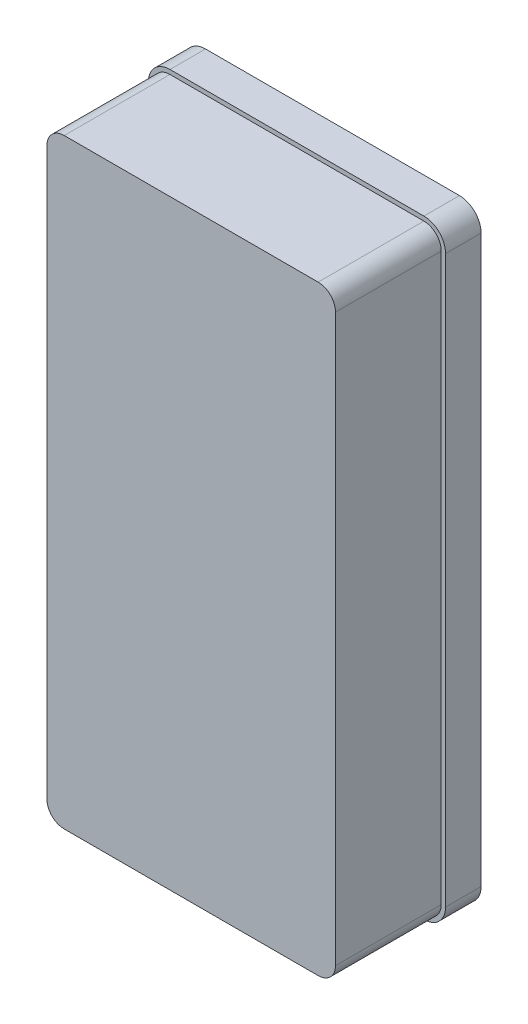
ISO-10303-21;
HEADER;
FILE_DESCRIPTION(('STEP AP214'),'2;1');
FILE_NAME('part.step','',(''),(''),'','','');
FILE_SCHEMA(('AUTOMOTIVE_DESIGN { 1 0 10303 214 1 1 1 1 }'));
ENDSEC;
DATA;
#1=APPLICATION_CONTEXT('core data for automotive mechanical design processes');
#2=APPLICATION_PROTOCOL_DEFINITION('international standard','automotive_design',2000,#1);
#3=PRODUCT_CONTEXT('',#1,'mechanical');
#4=PRODUCT('Part','Part','',(#3));
#5=PRODUCT_RELATED_PRODUCT_CATEGORY('part','',(#4));
#6=PRODUCT_DEFINITION_FORMATION('','',#4);
#7=PRODUCT_DEFINITION_CONTEXT('part definition',#1,'design');
#8=PRODUCT_DEFINITION('design','',#6,#7);
#9=PRODUCT_DEFINITION_SHAPE('','',#8);
#10=(LENGTH_UNIT() NAMED_UNIT(*) SI_UNIT(.MILLI.,.METRE.));
#11=(NAMED_UNIT(*) PLANE_ANGLE_UNIT() SI_UNIT($,.RADIAN.));
#12=(NAMED_UNIT(*) SI_UNIT($,.STERADIAN.) SOLID_ANGLE_UNIT());
#13=UNCERTAINTY_MEASURE_WITH_UNIT(LENGTH_MEASURE(1.E-05),#10,'distance_accuracy_value','');
#14=(GEOMETRIC_REPRESENTATION_CONTEXT(3) GLOBAL_UNCERTAINTY_ASSIGNED_CONTEXT((#13)) GLOBAL_UNIT_ASSIGNED_CONTEXT((#10,
#11,#12)) REPRESENTATION_CONTEXT('',''));
#15=CARTESIAN_POINT('',(0.,0.,0.));
#16=DIRECTION('',(0.,0.,1.));
#17=DIRECTION('',(1.,0.,0.));
#18=AXIS2_PLACEMENT_3D('',#15,#16,#17);
#19=CARTESIAN_POINT('',(-14.65,32.65,4.1));
#20=DIRECTION('',(0.,0.,1.));
#21=DIRECTION('',(1.,0.,0.));
#22=AXIS2_PLACEMENT_3D('',#19,#20,#21);
#23=PLANE('',#22);
#24=CARTESIAN_POINT('',(-14.65,32.65,4.1));
#25=DIRECTION('',(0.,0.,1.));
#26=DIRECTION('',(1.,0.,0.));
#27=AXIS2_PLACEMENT_3D('',#24,#25,#26);
#28=CIRCLE('',#27,2.5);
#29=CARTESIAN_POINT('',(-14.65,35.15,4.1));
#30=VERTEX_POINT('',#29);
#31=CARTESIAN_POINT('',(-17.15,32.65,4.1));
#32=VERTEX_POINT('',#31);
#33=EDGE_CURVE('E155',#30,#32,#28,.T.);
#34=ORIENTED_EDGE('',*,*,#33,.T.);
#35=DIRECTION('',(0.,-1.,0.));
#36=VECTOR('',#35,1.);
#37=CARTESIAN_POINT('',(-17.15,32.65,4.1));
#38=LINE('',#37,#36);
#39=CARTESIAN_POINT('',(-17.15,-32.65,4.1));
#40=VERTEX_POINT('',#39);
#41=EDGE_CURVE('E95',#32,#40,#38,.T.);
#42=ORIENTED_EDGE('',*,*,#41,.T.);
#43=CARTESIAN_POINT('',(-14.65,-32.65,4.1));
#44=DIRECTION('',(0.,0.,1.));
#45=DIRECTION('',(1.,0.,0.));
#46=AXIS2_PLACEMENT_3D('',#43,#44,#45);
#47=CIRCLE('',#46,2.5);
#48=CARTESIAN_POINT('',(-14.65,-35.15,4.1));
#49=VERTEX_POINT('',#48);
#50=EDGE_CURVE('E170',#40,#49,#47,.T.);
#51=ORIENTED_EDGE('',*,*,#50,.T.);
#52=DIRECTION('',(1.,0.,0.));
#53=VECTOR('',#52,1.);
#54=CARTESIAN_POINT('',(-14.65,-35.15,4.1));
#55=LINE('',#54,#53);
#56=CARTESIAN_POINT('',(14.65,-35.15,4.1));
#57=VERTEX_POINT('',#56);
#58=EDGE_CURVE('E182',#49,#57,#55,.T.);
#59=ORIENTED_EDGE('',*,*,#58,.T.);
#60=CARTESIAN_POINT('',(14.65,-32.65,4.1));
#61=DIRECTION('',(0.,0.,1.));
#62=DIRECTION('',(1.,0.,0.));
#63=AXIS2_PLACEMENT_3D('',#60,#61,#62);
#64=CIRCLE('',#63,2.5);
#65=CARTESIAN_POINT('',(17.15,-32.65,4.1));
#66=VERTEX_POINT('',#65);
#67=EDGE_CURVE('E118',#57,#66,#64,.T.);
#68=ORIENTED_EDGE('',*,*,#67,.T.);
#69=DIRECTION('',(0.,1.,0.));
#70=VECTOR('',#69,1.);
#71=CARTESIAN_POINT('',(17.15,32.65,4.1));
#72=LINE('',#71,#70);
#73=CARTESIAN_POINT('',(17.15,32.65,4.1));
#74=VERTEX_POINT('',#73);
#75=EDGE_CURVE('E111',#66,#74,#72,.T.);
#76=ORIENTED_EDGE('',*,*,#75,.T.);
#77=CARTESIAN_POINT('',(14.65,32.65,4.1));
#78=DIRECTION('',(0.,0.,1.));
#79=DIRECTION('',(-1.,0.,0.));
#80=AXIS2_PLACEMENT_3D('',#77,#78,#79);
#81=CIRCLE('',#80,2.5);
#82=CARTESIAN_POINT('',(14.65,35.15,4.1));
#83=VERTEX_POINT('',#82);
#84=EDGE_CURVE('E115',#74,#83,#81,.T.);
#85=ORIENTED_EDGE('',*,*,#84,.T.);
#86=DIRECTION('',(-1.,0.,0.));
#87=VECTOR('',#86,1.);
#88=CARTESIAN_POINT('',(-14.65,35.15,4.1));
#89=LINE('',#88,#87);
#90=EDGE_CURVE('E54',#83,#30,#89,.T.);
#91=ORIENTED_EDGE('',*,*,#90,.T.);
#92=EDGE_LOOP('',(#34,#42,#51,#59,#68,#76,#85,#91));
#93=FACE_BOUND('',#92,.T.);
#94=DIRECTION('',(1.,0.,0.));
#95=VECTOR('',#94,1.);
#96=CARTESIAN_POINT('',(-14.65,-34.65,4.1));
#97=LINE('',#96,#95);
#98=CARTESIAN_POINT('',(-14.65,-34.65,4.1));
#99=VERTEX_POINT('',#98);
#100=CARTESIAN_POINT('',(14.65,-34.65,4.1));
#101=VERTEX_POINT('',#100);
#102=EDGE_CURVE('E227',#99,#101,#97,.T.);
#103=ORIENTED_EDGE('',*,*,#102,.F.);
#104=CARTESIAN_POINT('',(-14.65,-32.65,4.1));
#105=DIRECTION('',(0.,0.,1.));
#106=DIRECTION('',(1.,0.,0.));
#107=AXIS2_PLACEMENT_3D('',#104,#105,#106);
#108=CIRCLE('',#107,1.99999999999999);
#109=CARTESIAN_POINT('',(-16.65,-32.65,4.1));
#110=VERTEX_POINT('',#109);
#111=EDGE_CURVE('E230',#110,#99,#108,.T.);
#112=ORIENTED_EDGE('',*,*,#111,.F.);
#113=DIRECTION('',(0.,-1.,0.));
#114=VECTOR('',#113,1.);
#115=CARTESIAN_POINT('',(-16.65,32.65,4.1));
#116=LINE('',#115,#114);
#117=CARTESIAN_POINT('',(-16.65,32.65,4.1));
#118=VERTEX_POINT('',#117);
#119=EDGE_CURVE('E210',#118,#110,#116,.T.);
#120=ORIENTED_EDGE('',*,*,#119,.F.);
#121=CARTESIAN_POINT('',(-14.65,32.65,4.1));
#122=DIRECTION('',(0.,0.,1.));
#123=DIRECTION('',(1.,0.,0.));
#124=AXIS2_PLACEMENT_3D('',#121,#122,#123);
#125=CIRCLE('',#124,2.00000000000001);
#126=CARTESIAN_POINT('',(-14.65,34.65,4.1));
#127=VERTEX_POINT('',#126);
#128=EDGE_CURVE('E213',#127,#118,#125,.T.);
#129=ORIENTED_EDGE('',*,*,#128,.F.);
#130=DIRECTION('',(-1.,0.,0.));
#131=VECTOR('',#130,1.);
#132=CARTESIAN_POINT('',(14.65,34.65,4.1));
#133=LINE('',#132,#131);
#134=CARTESIAN_POINT('',(14.65,34.65,4.1));
#135=VERTEX_POINT('',#134);
#136=EDGE_CURVE('E215',#135,#127,#133,.T.);
#137=ORIENTED_EDGE('',*,*,#136,.F.);
#138=CARTESIAN_POINT('',(14.65,32.65,4.1));
#139=DIRECTION('',(0.,0.,1.));
#140=DIRECTION('',(1.,0.,0.));
#141=AXIS2_PLACEMENT_3D('',#138,#139,#140);
#142=CIRCLE('',#141,2.00000000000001);
#143=CARTESIAN_POINT('',(16.65,32.65,4.1));
#144=VERTEX_POINT('',#143);
#145=EDGE_CURVE('E218',#144,#135,#142,.T.);
#146=ORIENTED_EDGE('',*,*,#145,.F.);
#147=DIRECTION('',(0.,1.,0.));
#148=VECTOR('',#147,1.);
#149=CARTESIAN_POINT('',(16.65,-32.65,4.1));
#150=LINE('',#149,#148);
#151=CARTESIAN_POINT('',(16.65,-32.65,4.1));
#152=VERTEX_POINT('',#151);
#153=EDGE_CURVE('E221',#152,#144,#150,.T.);
#154=ORIENTED_EDGE('',*,*,#153,.F.);
#155=CARTESIAN_POINT('',(14.65,-32.65,4.1));
#156=DIRECTION('',(0.,0.,1.));
#157=DIRECTION('',(1.,0.,0.));
#158=AXIS2_PLACEMENT_3D('',#155,#156,#157);
#159=CIRCLE('',#158,1.99999999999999);
#160=EDGE_CURVE('E224',#101,#152,#159,.T.);
#161=ORIENTED_EDGE('',*,*,#160,.F.);
#162=EDGE_LOOP('',(#103,#112,#120,#129,#137,#146,#154,#161));
#163=FACE_BOUND('',#162,.T.);
#164=ADVANCED_FACE('F30',(#93,#163),#23,.T.);
#165=CARTESIAN_POINT('',(-14.65,32.65,4.1));
#166=DIRECTION('',(0.,0.,-1.));
#167=DIRECTION('',(-1.,0.,0.));
#168=AXIS2_PLACEMENT_3D('',#165,#166,#167);
#169=CYLINDRICAL_SURFACE('',#168,2.5);
#170=CARTESIAN_POINT('',(-14.65,32.65,0.));
#171=DIRECTION('',(0.,0.,1.));
#172=DIRECTION('',(1.,0.,0.));
#173=AXIS2_PLACEMENT_3D('',#170,#171,#172);
#174=CIRCLE('',#173,2.5);
#175=CARTESIAN_POINT('',(-14.65,35.15,0.));
#176=VERTEX_POINT('',#175);
#177=CARTESIAN_POINT('',(-17.15,32.65,0.));
#178=VERTEX_POINT('',#177);
#179=EDGE_CURVE('E139',#176,#178,#174,.T.);
#180=ORIENTED_EDGE('',*,*,#179,.T.);
#181=DIRECTION('',(0.,0.,-1.));
#182=VECTOR('',#181,1.);
#183=CARTESIAN_POINT('',(-17.15,32.65,4.1));
#184=LINE('',#183,#182);
#185=EDGE_CURVE('E11',#32,#178,#184,.T.);
#186=ORIENTED_EDGE('',*,*,#185,.F.);
#187=ORIENTED_EDGE('',*,*,#33,.F.);
#188=DIRECTION('',(0.,0.,-1.));
#189=VECTOR('',#188,1.);
#190=CARTESIAN_POINT('',(-14.65,35.15,4.1));
#191=LINE('',#190,#189);
#192=EDGE_CURVE('E135',#30,#176,#191,.T.);
#193=ORIENTED_EDGE('',*,*,#192,.T.);
#194=EDGE_LOOP('',(#180,#186,#187,#193));
#195=FACE_BOUND('',#194,.T.);
#196=ADVANCED_FACE('F32',(#195),#169,.T.);
#197=CARTESIAN_POINT('',(-17.15,32.65,4.1));
#198=DIRECTION('',(1.,0.,0.));
#199=DIRECTION('',(0.,1.,0.));
#200=AXIS2_PLACEMENT_3D('',#197,#198,#199);
#201=PLANE('',#200);
#202=DIRECTION('',(0.,-1.,0.));
#203=VECTOR('',#202,1.);
#204=CARTESIAN_POINT('',(-17.15,32.65,0.));
#205=LINE('',#204,#203);
#206=CARTESIAN_POINT('',(-17.15,-32.65,0.));
#207=VERTEX_POINT('',#206);
#208=EDGE_CURVE('E142',#178,#207,#205,.T.);
#209=ORIENTED_EDGE('',*,*,#208,.T.);
#210=DIRECTION('',(0.,0.,-1.));
#211=VECTOR('',#210,1.);
#212=CARTESIAN_POINT('',(-17.15,-32.65,4.1));
#213=LINE('',#212,#211);
#214=EDGE_CURVE('E38',#40,#207,#213,.T.);
#215=ORIENTED_EDGE('',*,*,#214,.F.);
#216=ORIENTED_EDGE('',*,*,#41,.F.);
#217=ORIENTED_EDGE('',*,*,#185,.T.);
#218=EDGE_LOOP('',(#209,#215,#216,#217));
#219=FACE_BOUND('',#218,.T.);
#220=ADVANCED_FACE('F332',(#219),#201,.F.);
#221=CARTESIAN_POINT('',(-14.65,-32.65,4.1));
#222=DIRECTION('',(0.,0.,-1.));
#223=DIRECTION('',(-1.,0.,0.));
#224=AXIS2_PLACEMENT_3D('',#221,#222,#223);
#225=CYLINDRICAL_SURFACE('',#224,2.5);
#226=CARTESIAN_POINT('',(-14.65,-32.65,0.));
#227=DIRECTION('',(0.,0.,1.));
#228=DIRECTION('',(1.,0.,0.));
#229=AXIS2_PLACEMENT_3D('',#226,#227,#228);
#230=CIRCLE('',#229,2.5);
#231=CARTESIAN_POINT('',(-14.65,-35.15,0.));
#232=VERTEX_POINT('',#231);
#233=EDGE_CURVE('E145',#207,#232,#230,.T.);
#234=ORIENTED_EDGE('',*,*,#233,.T.);
#235=DIRECTION('',(0.,0.,-1.));
#236=VECTOR('',#235,1.);
#237=CARTESIAN_POINT('',(-14.65,-35.15,4.1));
#238=LINE('',#237,#236);
#239=EDGE_CURVE('E162',#49,#232,#238,.T.);
#240=ORIENTED_EDGE('',*,*,#239,.F.);
#241=ORIENTED_EDGE('',*,*,#50,.F.);
#242=ORIENTED_EDGE('',*,*,#214,.T.);
#243=EDGE_LOOP('',(#234,#240,#241,#242));
#244=FACE_BOUND('',#243,.T.);
#245=ADVANCED_FACE('F168',(#244),#225,.T.);
#246=CARTESIAN_POINT('',(-14.65,-35.15,4.1));
#247=DIRECTION('',(0.,1.,0.));
#248=DIRECTION('',(0.,0.,1.));
#249=AXIS2_PLACEMENT_3D('',#246,#247,#248);
#250=PLANE('',#249);
#251=DIRECTION('',(1.,0.,0.));
#252=VECTOR('',#251,1.);
#253=CARTESIAN_POINT('',(-14.65,-35.15,0.));
#254=LINE('',#253,#252);
#255=CARTESIAN_POINT('',(14.65,-35.15,0.));
#256=VERTEX_POINT('',#255);
#257=EDGE_CURVE('E147',#232,#256,#254,.T.);
#258=ORIENTED_EDGE('',*,*,#257,.T.);
#259=DIRECTION('',(0.,0.,-1.));
#260=VECTOR('',#259,1.);
#261=CARTESIAN_POINT('',(14.65,-35.15,4.1));
#262=LINE('',#261,#260);
#263=EDGE_CURVE('E159',#57,#256,#262,.T.);
#264=ORIENTED_EDGE('',*,*,#263,.F.);
#265=ORIENTED_EDGE('',*,*,#58,.F.);
#266=ORIENTED_EDGE('',*,*,#239,.T.);
#267=EDGE_LOOP('',(#258,#264,#265,#266));
#268=FACE_BOUND('',#267,.T.);
#269=ADVANCED_FACE('F178',(#268),#250,.F.);
#270=CARTESIAN_POINT('',(14.65,-32.65,4.1));
#271=DIRECTION('',(0.,0.,-1.));
#272=DIRECTION('',(-1.,0.,0.));
#273=AXIS2_PLACEMENT_3D('',#270,#271,#272);
#274=CYLINDRICAL_SURFACE('',#273,2.5);
#275=CARTESIAN_POINT('',(14.65,-32.65,0.));
#276=DIRECTION('',(0.,0.,1.));
#277=DIRECTION('',(1.,0.,0.));
#278=AXIS2_PLACEMENT_3D('',#275,#276,#277);
#279=CIRCLE('',#278,2.5);
#280=CARTESIAN_POINT('',(17.15,-32.65,0.));
#281=VERTEX_POINT('',#280);
#282=EDGE_CURVE('E149',#256,#281,#279,.T.);
#283=ORIENTED_EDGE('',*,*,#282,.T.);
#284=DIRECTION('',(0.,0.,-1.));
#285=VECTOR('',#284,1.);
#286=CARTESIAN_POINT('',(17.15,-32.65,4.1));
#287=LINE('',#286,#285);
#288=EDGE_CURVE('E130',#66,#281,#287,.T.);
#289=ORIENTED_EDGE('',*,*,#288,.F.);
#290=ORIENTED_EDGE('',*,*,#67,.F.);
#291=ORIENTED_EDGE('',*,*,#263,.T.);
#292=EDGE_LOOP('',(#283,#289,#290,#291));
#293=FACE_BOUND('',#292,.T.);
#294=ADVANCED_FACE('F181',(#293),#274,.T.);
#295=CARTESIAN_POINT('',(17.15,32.65,4.1));
#296=DIRECTION('',(-1.,0.,0.));
#297=DIRECTION('',(0.,-1.,0.));
#298=AXIS2_PLACEMENT_3D('',#295,#296,#297);
#299=PLANE('',#298);
#300=DIRECTION('',(0.,1.,0.));
#301=VECTOR('',#300,1.);
#302=CARTESIAN_POINT('',(17.15,32.65,0.));
#303=LINE('',#302,#301);
#304=CARTESIAN_POINT('',(17.15,32.65,0.));
#305=VERTEX_POINT('',#304);
#306=EDGE_CURVE('E127',#281,#305,#303,.T.);
#307=ORIENTED_EDGE('',*,*,#306,.T.);
#308=DIRECTION('',(0.,0.,-1.));
#309=VECTOR('',#308,1.);
#310=CARTESIAN_POINT('',(17.15,32.65,4.1));
#311=LINE('',#310,#309);
#312=EDGE_CURVE('E124',#74,#305,#311,.T.);
#313=ORIENTED_EDGE('',*,*,#312,.F.);
#314=ORIENTED_EDGE('',*,*,#75,.F.);
#315=ORIENTED_EDGE('',*,*,#288,.T.);
#316=EDGE_LOOP('',(#307,#313,#314,#315));
#317=FACE_BOUND('',#316,.T.);
#318=ADVANCED_FACE('F125',(#317),#299,.F.);
#319=CARTESIAN_POINT('',(14.65,32.65,4.1));
#320=DIRECTION('',(0.,0.,-1.));
#321=DIRECTION('',(-1.,0.,0.));
#322=AXIS2_PLACEMENT_3D('',#319,#320,#321);
#323=CYLINDRICAL_SURFACE('',#322,2.5);
#324=CARTESIAN_POINT('',(14.65,32.65,0.));
#325=DIRECTION('',(0.,0.,1.));
#326=DIRECTION('',(-1.,0.,0.));
#327=AXIS2_PLACEMENT_3D('',#324,#325,#326);
#328=CIRCLE('',#327,2.5);
#329=CARTESIAN_POINT('',(14.65,35.15,0.));
#330=VERTEX_POINT('',#329);
#331=EDGE_CURVE('E152',#305,#330,#328,.T.);
#332=ORIENTED_EDGE('',*,*,#331,.T.);
#333=DIRECTION('',(0.,0.,-1.));
#334=VECTOR('',#333,1.);
#335=CARTESIAN_POINT('',(14.65,35.15,4.1));
#336=LINE('',#335,#334);
#337=EDGE_CURVE('E131',#83,#330,#336,.T.);
#338=ORIENTED_EDGE('',*,*,#337,.F.);
#339=ORIENTED_EDGE('',*,*,#84,.F.);
#340=ORIENTED_EDGE('',*,*,#312,.T.);
#341=EDGE_LOOP('',(#332,#338,#339,#340));
#342=FACE_BOUND('',#341,.T.);
#343=ADVANCED_FACE('F133',(#342),#323,.T.);
#344=CARTESIAN_POINT('',(-14.65,35.15,4.1));
#345=DIRECTION('',(0.,-1.,0.));
#346=DIRECTION('',(0.,0.,-1.));
#347=AXIS2_PLACEMENT_3D('',#344,#345,#346);
#348=PLANE('',#347);
#349=DIRECTION('',(-1.,0.,0.));
#350=VECTOR('',#349,1.);
#351=CARTESIAN_POINT('',(-14.65,35.15,0.));
#352=LINE('',#351,#350);
#353=EDGE_CURVE('E87',#330,#176,#352,.T.);
#354=ORIENTED_EDGE('',*,*,#353,.T.);
#355=ORIENTED_EDGE('',*,*,#192,.F.);
#356=ORIENTED_EDGE('',*,*,#90,.F.);
#357=ORIENTED_EDGE('',*,*,#337,.T.);
#358=EDGE_LOOP('',(#354,#355,#356,#357));
#359=FACE_BOUND('',#358,.T.);
#360=ADVANCED_FACE('F339',(#359),#348,.F.);
#361=CARTESIAN_POINT('',(-14.65,32.65,0.));
#362=DIRECTION('',(0.,0.,1.));
#363=DIRECTION('',(1.,0.,0.));
#364=AXIS2_PLACEMENT_3D('',#361,#362,#363);
#365=PLANE('',#364);
#366=ORIENTED_EDGE('',*,*,#179,.F.);
#367=ORIENTED_EDGE('',*,*,#353,.F.);
#368=ORIENTED_EDGE('',*,*,#331,.F.);
#369=ORIENTED_EDGE('',*,*,#306,.F.);
#370=ORIENTED_EDGE('',*,*,#282,.F.);
#371=ORIENTED_EDGE('',*,*,#257,.F.);
#372=ORIENTED_EDGE('',*,*,#233,.F.);
#373=ORIENTED_EDGE('',*,*,#208,.F.);
#374=EDGE_LOOP('',(#366,#367,#368,#369,#370,#371,#372,#373));
#375=FACE_BOUND('',#374,.T.);
#376=ADVANCED_FACE('F174',(#375),#365,.F.);
#377=CARTESIAN_POINT('',(-14.65,-32.65,16.3));
#378=DIRECTION('',(0.,0.,-1.));
#379=DIRECTION('',(-1.,0.,0.));
#380=AXIS2_PLACEMENT_3D('',#377,#378,#379);
#381=CYLINDRICAL_SURFACE('',#380,1.99999999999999);
#382=ORIENTED_EDGE('',*,*,#111,.T.);
#383=DIRECTION('',(0.,0.,-1.));
#384=VECTOR('',#383,1.);
#385=CARTESIAN_POINT('',(-14.65,-34.65,16.3));
#386=LINE('',#385,#384);
#387=CARTESIAN_POINT('',(-14.65,-34.65,16.3));
#388=VERTEX_POINT('',#387);
#389=EDGE_CURVE('E143',#388,#99,#386,.T.);
#390=ORIENTED_EDGE('',*,*,#389,.F.);
#391=CARTESIAN_POINT('',(-14.65,-32.65,16.3));
#392=DIRECTION('',(0.,0.,1.));
#393=DIRECTION('',(1.,0.,0.));
#394=AXIS2_PLACEMENT_3D('',#391,#392,#393);
#395=CIRCLE('',#394,1.99999999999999);
#396=CARTESIAN_POINT('',(-16.65,-32.65,16.3));
#397=VERTEX_POINT('',#396);
#398=EDGE_CURVE('E212',#397,#388,#395,.T.);
#399=ORIENTED_EDGE('',*,*,#398,.F.);
#400=DIRECTION('',(0.,0.,-1.));
#401=VECTOR('',#400,1.);
#402=CARTESIAN_POINT('',(-16.65,-32.65,16.3));
#403=LINE('',#402,#401);
#404=EDGE_CURVE('E206',#397,#110,#403,.T.);
#405=ORIENTED_EDGE('',*,*,#404,.T.);
#406=EDGE_LOOP('',(#382,#390,#399,#405));
#407=FACE_BOUND('',#406,.T.);
#408=ADVANCED_FACE('F265',(#407),#381,.T.);
#409=CARTESIAN_POINT('',(-14.65,-34.65,16.3));
#410=DIRECTION('',(0.,1.,0.));
#411=DIRECTION('',(0.,0.,1.));
#412=AXIS2_PLACEMENT_3D('',#409,#410,#411);
#413=PLANE('',#412);
#414=ORIENTED_EDGE('',*,*,#102,.T.);
#415=DIRECTION('',(0.,0.,-1.));
#416=VECTOR('',#415,1.);
#417=CARTESIAN_POINT('',(14.65,-34.65,16.3));
#418=LINE('',#417,#416);
#419=CARTESIAN_POINT('',(14.65,-34.65,16.3));
#420=VERTEX_POINT('',#419);
#421=EDGE_CURVE('E190',#420,#101,#418,.T.);
#422=ORIENTED_EDGE('',*,*,#421,.F.);
#423=DIRECTION('',(1.,0.,0.));
#424=VECTOR('',#423,1.);
#425=CARTESIAN_POINT('',(-14.65,-34.65,16.3));
#426=LINE('',#425,#424);
#427=EDGE_CURVE('E250',#388,#420,#426,.T.);
#428=ORIENTED_EDGE('',*,*,#427,.F.);
#429=ORIENTED_EDGE('',*,*,#389,.T.);
#430=EDGE_LOOP('',(#414,#422,#428,#429));
#431=FACE_BOUND('',#430,.T.);
#432=ADVANCED_FACE('F270',(#431),#413,.F.);
#433=CARTESIAN_POINT('',(14.65,-32.65,16.3));
#434=DIRECTION('',(0.,0.,-1.));
#435=DIRECTION('',(-1.,0.,0.));
#436=AXIS2_PLACEMENT_3D('',#433,#434,#435);
#437=CYLINDRICAL_SURFACE('',#436,1.99999999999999);
#438=ORIENTED_EDGE('',*,*,#160,.T.);
#439=DIRECTION('',(0.,0.,-1.));
#440=VECTOR('',#439,1.);
#441=CARTESIAN_POINT('',(16.65,-32.65,16.3));
#442=LINE('',#441,#440);
#443=CARTESIAN_POINT('',(16.65,-32.65,16.3));
#444=VERTEX_POINT('',#443);
#445=EDGE_CURVE('E193',#444,#152,#442,.T.);
#446=ORIENTED_EDGE('',*,*,#445,.F.);
#447=CARTESIAN_POINT('',(14.65,-32.65,16.3));
#448=DIRECTION('',(0.,0.,1.));
#449=DIRECTION('',(1.,0.,0.));
#450=AXIS2_PLACEMENT_3D('',#447,#448,#449);
#451=CIRCLE('',#450,1.99999999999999);
#452=EDGE_CURVE('E247',#420,#444,#451,.T.);
#453=ORIENTED_EDGE('',*,*,#452,.F.);
#454=ORIENTED_EDGE('',*,*,#421,.T.);
#455=EDGE_LOOP('',(#438,#446,#453,#454));
#456=FACE_BOUND('',#455,.T.);
#457=ADVANCED_FACE('F294',(#456),#437,.T.);
#458=CARTESIAN_POINT('',(16.65,-32.65,16.3));
#459=DIRECTION('',(-1.,0.,0.));
#460=DIRECTION('',(0.,-1.,0.));
#461=AXIS2_PLACEMENT_3D('',#458,#459,#460);
#462=PLANE('',#461);
#463=ORIENTED_EDGE('',*,*,#153,.T.);
#464=DIRECTION('',(0.,0.,-1.));
#465=VECTOR('',#464,1.);
#466=CARTESIAN_POINT('',(16.65,32.65,16.3));
#467=LINE('',#466,#465);
#468=CARTESIAN_POINT('',(16.65,32.65,16.3));
#469=VERTEX_POINT('',#468);
#470=EDGE_CURVE('E196',#469,#144,#467,.T.);
#471=ORIENTED_EDGE('',*,*,#470,.F.);
#472=DIRECTION('',(0.,1.,0.));
#473=VECTOR('',#472,1.);
#474=CARTESIAN_POINT('',(16.65,-32.65,16.3));
#475=LINE('',#474,#473);
#476=EDGE_CURVE('E244',#444,#469,#475,.T.);
#477=ORIENTED_EDGE('',*,*,#476,.F.);
#478=ORIENTED_EDGE('',*,*,#445,.T.);
#479=EDGE_LOOP('',(#463,#471,#477,#478));
#480=FACE_BOUND('',#479,.T.);
#481=ADVANCED_FACE('F299',(#480),#462,.F.);
#482=CARTESIAN_POINT('',(14.65,32.65,16.3));
#483=DIRECTION('',(0.,0.,-1.));
#484=DIRECTION('',(-1.,0.,0.));
#485=AXIS2_PLACEMENT_3D('',#482,#483,#484);
#486=CYLINDRICAL_SURFACE('',#485,2.00000000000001);
#487=ORIENTED_EDGE('',*,*,#145,.T.);
#488=DIRECTION('',(0.,0.,-1.));
#489=VECTOR('',#488,1.);
#490=CARTESIAN_POINT('',(14.65,34.65,16.3));
#491=LINE('',#490,#489);
#492=CARTESIAN_POINT('',(14.65,34.65,16.3));
#493=VERTEX_POINT('',#492);
#494=EDGE_CURVE('E199',#493,#135,#491,.T.);
#495=ORIENTED_EDGE('',*,*,#494,.F.);
#496=CARTESIAN_POINT('',(14.65,32.65,16.3));
#497=DIRECTION('',(0.,0.,1.));
#498=DIRECTION('',(1.,0.,0.));
#499=AXIS2_PLACEMENT_3D('',#496,#497,#498);
#500=CIRCLE('',#499,2.00000000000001);
#501=EDGE_CURVE('E241',#469,#493,#500,.T.);
#502=ORIENTED_EDGE('',*,*,#501,.F.);
#503=ORIENTED_EDGE('',*,*,#470,.T.);
#504=EDGE_LOOP('',(#487,#495,#502,#503));
#505=FACE_BOUND('',#504,.T.);
#506=ADVANCED_FACE('F317',(#505),#486,.T.);
#507=CARTESIAN_POINT('',(14.65,34.65,16.3));
#508=DIRECTION('',(0.,-1.,0.));
#509=DIRECTION('',(0.,0.,-1.));
#510=AXIS2_PLACEMENT_3D('',#507,#508,#509);
#511=PLANE('',#510);
#512=ORIENTED_EDGE('',*,*,#136,.T.);
#513=DIRECTION('',(0.,0.,-1.));
#514=VECTOR('',#513,1.);
#515=CARTESIAN_POINT('',(-14.65,34.65,16.3));
#516=LINE('',#515,#514);
#517=CARTESIAN_POINT('',(-14.65,34.65,16.3));
#518=VERTEX_POINT('',#517);
#519=EDGE_CURVE('E202',#518,#127,#516,.T.);
#520=ORIENTED_EDGE('',*,*,#519,.F.);
#521=DIRECTION('',(-1.,0.,0.));
#522=VECTOR('',#521,1.);
#523=CARTESIAN_POINT('',(14.65,34.65,16.3));
#524=LINE('',#523,#522);
#525=EDGE_CURVE('E238',#493,#518,#524,.T.);
#526=ORIENTED_EDGE('',*,*,#525,.F.);
#527=ORIENTED_EDGE('',*,*,#494,.T.);
#528=EDGE_LOOP('',(#512,#520,#526,#527));
#529=FACE_BOUND('',#528,.T.);
#530=ADVANCED_FACE('F318',(#529),#511,.F.);
#531=CARTESIAN_POINT('',(-14.65,32.65,16.3));
#532=DIRECTION('',(0.,0.,-1.));
#533=DIRECTION('',(-1.,0.,0.));
#534=AXIS2_PLACEMENT_3D('',#531,#532,#533);
#535=CYLINDRICAL_SURFACE('',#534,2.00000000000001);
#536=ORIENTED_EDGE('',*,*,#128,.T.);
#537=DIRECTION('',(0.,0.,-1.));
#538=VECTOR('',#537,1.);
#539=CARTESIAN_POINT('',(-16.65,32.65,16.3));
#540=LINE('',#539,#538);
#541=CARTESIAN_POINT('',(-16.65,32.65,16.3));
#542=VERTEX_POINT('',#541);
#543=EDGE_CURVE('E45',#542,#118,#540,.T.);
#544=ORIENTED_EDGE('',*,*,#543,.F.);
#545=CARTESIAN_POINT('',(-14.65,32.65,16.3));
#546=DIRECTION('',(0.,0.,1.));
#547=DIRECTION('',(1.,0.,0.));
#548=AXIS2_PLACEMENT_3D('',#545,#546,#547);
#549=CIRCLE('',#548,2.00000000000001);
#550=EDGE_CURVE('E235',#518,#542,#549,.T.);
#551=ORIENTED_EDGE('',*,*,#550,.F.);
#552=ORIENTED_EDGE('',*,*,#519,.T.);
#553=EDGE_LOOP('',(#536,#544,#551,#552));
#554=FACE_BOUND('',#553,.T.);
#555=ADVANCED_FACE('F315',(#554),#535,.T.);
#556=CARTESIAN_POINT('',(-16.65,32.65,16.3));
#557=DIRECTION('',(1.,0.,0.));
#558=DIRECTION('',(0.,1.,0.));
#559=AXIS2_PLACEMENT_3D('',#556,#557,#558);
#560=PLANE('',#559);
#561=ORIENTED_EDGE('',*,*,#119,.T.);
#562=ORIENTED_EDGE('',*,*,#404,.F.);
#563=DIRECTION('',(0.,-1.,0.));
#564=VECTOR('',#563,1.);
#565=CARTESIAN_POINT('',(-16.65,32.65,16.3));
#566=LINE('',#565,#564);
#567=EDGE_CURVE('E209',#542,#397,#566,.T.);
#568=ORIENTED_EDGE('',*,*,#567,.F.);
#569=ORIENTED_EDGE('',*,*,#543,.T.);
#570=EDGE_LOOP('',(#561,#562,#568,#569));
#571=FACE_BOUND('',#570,.T.);
#572=ADVANCED_FACE('F287',(#571),#560,.F.);
#573=CARTESIAN_POINT('',(-14.65,-32.65,16.3));
#574=DIRECTION('',(0.,0.,1.));
#575=DIRECTION('',(1.,0.,0.));
#576=AXIS2_PLACEMENT_3D('',#573,#574,#575);
#577=PLANE('',#576);
#578=ORIENTED_EDGE('',*,*,#398,.T.);
#579=ORIENTED_EDGE('',*,*,#427,.T.);
#580=ORIENTED_EDGE('',*,*,#452,.T.);
#581=ORIENTED_EDGE('',*,*,#476,.T.);
#582=ORIENTED_EDGE('',*,*,#501,.T.);
#583=ORIENTED_EDGE('',*,*,#525,.T.);
#584=ORIENTED_EDGE('',*,*,#550,.T.);
#585=ORIENTED_EDGE('',*,*,#567,.T.);
#586=EDGE_LOOP('',(#578,#579,#580,#581,#582,#583,#584,#585));
#587=FACE_BOUND('',#586,.T.);
#588=ADVANCED_FACE('F258',(#587),#577,.T.);
#589=CLOSED_SHELL('',(#164,#196,#220,#245,#269,#294,#318,#343,#360,#376,#408,#432,#457,#481,
#506,#530,#555,#572,#588));
#590=MANIFOLD_SOLID_BREP('B2',#589);
#591=ADVANCED_BREP_SHAPE_REPRESENTATION('',(#18,#590),#14);
#592=SHAPE_DEFINITION_REPRESENTATION(#9,#591);
ENDSEC;
END-ISO-10303-21;
